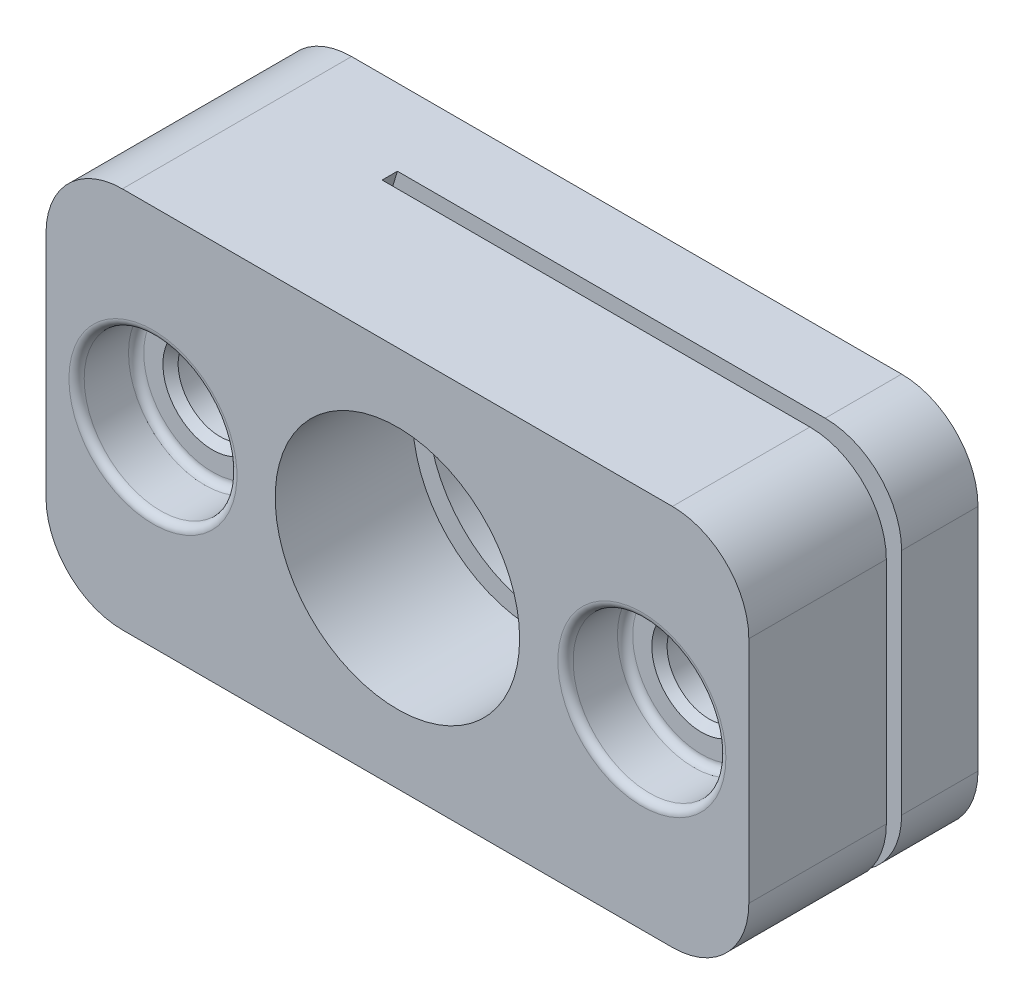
ISO-10303-21;
HEADER;
FILE_DESCRIPTION(('STEP AP214'),'2;1');
FILE_NAME('part.step','',(''),(''),'','','');
FILE_SCHEMA(('AUTOMOTIVE_DESIGN { 1 0 10303 214 1 1 1 1 }'));
ENDSEC;
DATA;
#1=APPLICATION_CONTEXT('core data for automotive mechanical design processes');
#2=APPLICATION_PROTOCOL_DEFINITION('international standard','automotive_design',2000,#1);
#3=PRODUCT_CONTEXT('',#1,'mechanical');
#4=PRODUCT('Part','Part','',(#3));
#5=PRODUCT_RELATED_PRODUCT_CATEGORY('part','',(#4));
#6=PRODUCT_DEFINITION_FORMATION('','',#4);
#7=PRODUCT_DEFINITION_CONTEXT('part definition',#1,'design');
#8=PRODUCT_DEFINITION('design','',#6,#7);
#9=PRODUCT_DEFINITION_SHAPE('','',#8);
#10=(LENGTH_UNIT() NAMED_UNIT(*) SI_UNIT(.MILLI.,.METRE.));
#11=(NAMED_UNIT(*) PLANE_ANGLE_UNIT() SI_UNIT($,.RADIAN.));
#12=(NAMED_UNIT(*) SI_UNIT($,.STERADIAN.) SOLID_ANGLE_UNIT());
#13=UNCERTAINTY_MEASURE_WITH_UNIT(LENGTH_MEASURE(1.E-05),#10,'distance_accuracy_value','');
#14=(GEOMETRIC_REPRESENTATION_CONTEXT(3) GLOBAL_UNCERTAINTY_ASSIGNED_CONTEXT((#13)) GLOBAL_UNIT_ASSIGNED_CONTEXT((#10,
#11,#12)) REPRESENTATION_CONTEXT('',''));
#15=CARTESIAN_POINT('',(0.,0.,0.));
#16=DIRECTION('',(0.,0.,1.));
#17=DIRECTION('',(1.,0.,0.));
#18=AXIS2_PLACEMENT_3D('',#15,#16,#17);
#19=CARTESIAN_POINT('',(35.25,0.,11.1));
#20=DIRECTION('',(0.,0.,1.));
#21=DIRECTION('',(1.,0.,0.));
#22=AXIS2_PLACEMENT_3D('',#19,#20,#21);
#23=PLANE('',#22);
#24=CARTESIAN_POINT('',(32.,0.,11.0999999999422));
#25=DIRECTION('',(0.,0.,1.));
#26=DIRECTION('',(1.,0.,0.));
#27=AXIS2_PLACEMENT_3D('',#24,#25,#26);
#28=CIRCLE('',#27,3.2499999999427);
#29=CARTESIAN_POINT('',(35.2499999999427,0.,11.0999999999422));
#30=VERTEX_POINT('',#29);
#31=EDGE_CURVE('E18',#30,#30,#28,.F.);
#32=ORIENTED_EDGE('',*,*,#31,.T.);
#33=EDGE_LOOP('',(#32));
#34=FACE_BOUND('',#33,.T.);
#35=CARTESIAN_POINT('',(32.,0.,11.1));
#36=DIRECTION('',(0.,0.,-1.));
#37=DIRECTION('',(1.,0.,0.));
#38=AXIS2_PLACEMENT_3D('',#35,#36,#37);
#39=CIRCLE('',#38,4.5);
#40=CARTESIAN_POINT('',(36.5,0.,11.1));
#41=VERTEX_POINT('',#40);
#42=EDGE_CURVE('E285',#41,#41,#39,.F.);
#43=ORIENTED_EDGE('',*,*,#42,.T.);
#44=EDGE_LOOP('',(#43));
#45=FACE_BOUND('',#44,.T.);
#46=ADVANCED_FACE('F14',(#34,#45),#23,.T.);
#47=CARTESIAN_POINT('',(32.,0.,11.6));
#48=DIRECTION('',(0.,0.,1.));
#49=DIRECTION('',(1.,0.,0.));
#50=AXIS2_PLACEMENT_3D('',#47,#48,#49);
#51=TOROIDAL_SURFACE('',#50,4.5,0.5);
#52=CARTESIAN_POINT('',(32.,0.,11.6));
#53=DIRECTION('',(0.,0.,-1.));
#54=DIRECTION('',(-1.,0.,0.));
#55=AXIS2_PLACEMENT_3D('',#52,#53,#54);
#56=CIRCLE('',#55,5.);
#57=CARTESIAN_POINT('',(27.,0.,11.6));
#58=VERTEX_POINT('',#57);
#59=EDGE_CURVE('E234',#58,#58,#56,.F.);
#60=ORIENTED_EDGE('',*,*,#59,.T.);
#61=EDGE_LOOP('',(#60));
#62=FACE_BOUND('',#61,.T.);
#63=ORIENTED_EDGE('',*,*,#42,.F.);
#64=EDGE_LOOP('',(#63));
#65=FACE_BOUND('',#64,.T.);
#66=ADVANCED_FACE('F267',(#62,#65),#51,.F.);
#67=CARTESIAN_POINT('',(0.,0.,11.6));
#68=DIRECTION('',(0.,0.,-1.));
#69=DIRECTION('',(-1.,0.,0.));
#70=AXIS2_PLACEMENT_3D('',#67,#68,#69);
#71=TOROIDAL_SURFACE('',#70,4.5,0.5);
#72=CARTESIAN_POINT('',(0.,0.,11.1));
#73=DIRECTION('',(0.,0.,-1.));
#74=DIRECTION('',(-1.,0.,0.));
#75=AXIS2_PLACEMENT_3D('',#72,#73,#74);
#76=CIRCLE('',#75,4.5);
#77=CARTESIAN_POINT('',(-4.5,0.,11.1));
#78=VERTEX_POINT('',#77);
#79=EDGE_CURVE('E245',#78,#78,#76,.F.);
#80=ORIENTED_EDGE('',*,*,#79,.F.);
#81=EDGE_LOOP('',(#80));
#82=FACE_BOUND('',#81,.T.);
#83=CARTESIAN_POINT('',(0.,0.,11.6));
#84=DIRECTION('',(0.,0.,1.));
#85=DIRECTION('',(1.,0.,0.));
#86=AXIS2_PLACEMENT_3D('',#83,#84,#85);
#87=CIRCLE('',#86,5.);
#88=CARTESIAN_POINT('',(5.,0.,11.6));
#89=VERTEX_POINT('',#88);
#90=EDGE_CURVE('E231',#89,#89,#87,.T.);
#91=ORIENTED_EDGE('',*,*,#90,.T.);
#92=EDGE_LOOP('',(#91));
#93=FACE_BOUND('',#92,.T.);
#94=ADVANCED_FACE('F263',(#82,#93),#71,.F.);
#95=CARTESIAN_POINT('',(-4.5,0.,11.1));
#96=DIRECTION('',(0.,0.,1.));
#97=DIRECTION('',(1.,0.,0.));
#98=AXIS2_PLACEMENT_3D('',#95,#96,#97);
#99=PLANE('',#98);
#100=ORIENTED_EDGE('',*,*,#79,.T.);
#101=EDGE_LOOP('',(#100));
#102=FACE_BOUND('',#101,.T.);
#103=CARTESIAN_POINT('',(0.,0.,11.099999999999));
#104=DIRECTION('',(0.,0.,1.));
#105=DIRECTION('',(1.,0.,0.));
#106=AXIS2_PLACEMENT_3D('',#103,#104,#105);
#107=CIRCLE('',#106,3.25000000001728);
#108=CARTESIAN_POINT('',(3.25000000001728,0.,11.099999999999));
#109=VERTEX_POINT('',#108);
#110=EDGE_CURVE('E228',#109,#109,#107,.F.);
#111=ORIENTED_EDGE('',*,*,#110,.T.);
#112=EDGE_LOOP('',(#111));
#113=FACE_BOUND('',#112,.T.);
#114=ADVANCED_FACE('F252',(#102,#113),#99,.T.);
#115=CARTESIAN_POINT('',(32.,0.,11.0999999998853));
#116=DIRECTION('',(0.,0.,1.));
#117=DIRECTION('',(1.,0.,0.));
#118=AXIS2_PLACEMENT_3D('',#115,#116,#117);
#119=CONICAL_SURFACE('',#118,3.24999999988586,0.785398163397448);
#120=CARTESIAN_POINT('',(32.,0.,10.6));
#121=DIRECTION('',(0.,0.,-1.));
#122=DIRECTION('',(-1.,0.,0.));
#123=AXIS2_PLACEMENT_3D('',#120,#121,#122);
#124=CIRCLE('',#123,2.75);
#125=CARTESIAN_POINT('',(29.25,0.,10.6));
#126=VERTEX_POINT('',#125);
#127=EDGE_CURVE('E224',#126,#126,#124,.T.);
#128=ORIENTED_EDGE('',*,*,#127,.T.);
#129=EDGE_LOOP('',(#128));
#130=FACE_BOUND('',#129,.T.);
#131=ORIENTED_EDGE('',*,*,#31,.F.);
#132=EDGE_LOOP('',(#131));
#133=FACE_BOUND('',#132,.T.);
#134=ADVANCED_FACE('F262',(#130,#133),#119,.F.);
#135=CARTESIAN_POINT('',(32.,0.,15.));
#136=DIRECTION('',(0.,0.,-1.));
#137=DIRECTION('',(-1.,0.,0.));
#138=AXIS2_PLACEMENT_3D('',#135,#136,#137);
#139=CYLINDRICAL_SURFACE('',#138,5.);
#140=ORIENTED_EDGE('',*,*,#59,.F.);
#141=EDGE_LOOP('',(#140));
#142=FACE_BOUND('',#141,.T.);
#143=CARTESIAN_POINT('',(32.,0.,14.5));
#144=DIRECTION('',(0.,0.,1.));
#145=DIRECTION('',(1.,0.,0.));
#146=AXIS2_PLACEMENT_3D('',#143,#144,#145);
#147=CIRCLE('',#146,5.);
#148=CARTESIAN_POINT('',(37.,0.,14.5));
#149=VERTEX_POINT('',#148);
#150=EDGE_CURVE('E125',#149,#149,#147,.F.);
#151=ORIENTED_EDGE('',*,*,#150,.F.);
#152=EDGE_LOOP('',(#151));
#153=FACE_BOUND('',#152,.T.);
#154=ADVANCED_FACE('F505',(#142,#153),#139,.F.);
#155=CARTESIAN_POINT('',(0.,0.,0.));
#156=DIRECTION('',(0.,0.,1.));
#157=DIRECTION('',(1.,0.,0.));
#158=AXIS2_PLACEMENT_3D('',#155,#156,#157);
#159=CYLINDRICAL_SURFACE('',#158,5.);
#160=CARTESIAN_POINT('',(0.,0.,14.5));
#161=DIRECTION('',(0.,0.,-1.));
#162=DIRECTION('',(-1.,0.,0.));
#163=AXIS2_PLACEMENT_3D('',#160,#161,#162);
#164=CIRCLE('',#163,5.);
#165=CARTESIAN_POINT('',(-5.,0.,14.5));
#166=VERTEX_POINT('',#165);
#167=EDGE_CURVE('E171',#166,#166,#164,.T.);
#168=ORIENTED_EDGE('',*,*,#167,.F.);
#169=EDGE_LOOP('',(#168));
#170=FACE_BOUND('',#169,.T.);
#171=ORIENTED_EDGE('',*,*,#90,.F.);
#172=EDGE_LOOP('',(#171));
#173=FACE_BOUND('',#172,.T.);
#174=ADVANCED_FACE('F349',(#170,#173),#159,.F.);
#175=CARTESIAN_POINT('',(0.,0.,11.099999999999));
#176=DIRECTION('',(0.,0.,1.));
#177=DIRECTION('',(1.,0.,0.));
#178=AXIS2_PLACEMENT_3D('',#175,#176,#177);
#179=CONICAL_SURFACE('',#178,3.25000000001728,0.785398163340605);
#180=ORIENTED_EDGE('',*,*,#110,.F.);
#181=EDGE_LOOP('',(#180));
#182=FACE_BOUND('',#181,.T.);
#183=CARTESIAN_POINT('',(0.,0.,10.6));
#184=DIRECTION('',(0.,0.,1.));
#185=DIRECTION('',(1.,0.,0.));
#186=AXIS2_PLACEMENT_3D('',#183,#184,#185);
#187=CIRCLE('',#186,2.75);
#188=CARTESIAN_POINT('',(2.75,0.,10.6));
#189=VERTEX_POINT('',#188);
#190=EDGE_CURVE('E167',#189,#189,#187,.F.);
#191=ORIENTED_EDGE('',*,*,#190,.T.);
#192=EDGE_LOOP('',(#191));
#193=FACE_BOUND('',#192,.T.);
#194=ADVANCED_FACE('F345',(#182,#193),#179,.F.);
#195=CARTESIAN_POINT('',(32.,0.,15.));
#196=DIRECTION('',(0.,0.,-1.));
#197=DIRECTION('',(-1.,0.,0.));
#198=AXIS2_PLACEMENT_3D('',#195,#196,#197);
#199=CYLINDRICAL_SURFACE('',#198,2.75);
#200=CARTESIAN_POINT('',(32.,0.,6.));
#201=DIRECTION('',(0.,0.,-1.));
#202=DIRECTION('',(-1.,0.,0.));
#203=AXIS2_PLACEMENT_3D('',#200,#201,#202);
#204=CIRCLE('',#203,2.75);
#205=CARTESIAN_POINT('',(29.25,0.,6.));
#206=VERTEX_POINT('',#205);
#207=EDGE_CURVE('E135',#206,#206,#204,.T.);
#208=ORIENTED_EDGE('',*,*,#207,.T.);
#209=EDGE_LOOP('',(#208));
#210=FACE_BOUND('',#209,.T.);
#211=ORIENTED_EDGE('',*,*,#127,.F.);
#212=EDGE_LOOP('',(#211));
#213=FACE_BOUND('',#212,.T.);
#214=ADVANCED_FACE('F348',(#210,#213),#199,.F.);
#215=CARTESIAN_POINT('',(43.9967103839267,0.,6.));
#216=DIRECTION('',(0.,0.,1.));
#217=DIRECTION('',(1.,0.,0.));
#218=AXIS2_PLACEMENT_3D('',#215,#216,#217);
#219=CYLINDRICAL_SURFACE('',#218,40.);
#220=DIRECTION('',(0.,0.,1.));
#221=VECTOR('',#220,1.);
#222=CARTESIAN_POINT('',(6.,12.5,6.));
#223=LINE('',#222,#221);
#224=CARTESIAN_POINT('',(6.,12.5,6.));
#225=VERTEX_POINT('',#224);
#226=CARTESIAN_POINT('',(6.,12.5,5.));
#227=VERTEX_POINT('',#226);
#228=EDGE_CURVE('E113',#225,#227,#223,.F.);
#229=ORIENTED_EDGE('',*,*,#228,.F.);
#230=CARTESIAN_POINT('',(43.9967103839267,0.,6.));
#231=DIRECTION('',(0.,0.,1.));
#232=DIRECTION('',(1.,0.,0.));
#233=AXIS2_PLACEMENT_3D('',#230,#231,#232);
#234=CIRCLE('',#233,40.);
#235=CARTESIAN_POINT('',(6.,-12.5,6.));
#236=VERTEX_POINT('',#235);
#237=EDGE_CURVE('E177',#225,#236,#234,.T.);
#238=ORIENTED_EDGE('',*,*,#237,.T.);
#239=DIRECTION('',(0.,0.,1.));
#240=VECTOR('',#239,1.);
#241=CARTESIAN_POINT('',(6.,-12.5,6.));
#242=LINE('',#241,#240);
#243=CARTESIAN_POINT('',(6.,-12.5,5.));
#244=VERTEX_POINT('',#243);
#245=EDGE_CURVE('E126',#244,#236,#242,.T.);
#246=ORIENTED_EDGE('',*,*,#245,.F.);
#247=CARTESIAN_POINT('',(43.9967103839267,0.,5.));
#248=DIRECTION('',(0.,0.,1.));
#249=DIRECTION('',(1.,0.,0.));
#250=AXIS2_PLACEMENT_3D('',#247,#248,#249);
#251=CIRCLE('',#250,40.);
#252=EDGE_CURVE('E130',#227,#244,#251,.T.);
#253=ORIENTED_EDGE('',*,*,#252,.F.);
#254=EDGE_LOOP('',(#229,#238,#246,#253));
#255=FACE_BOUND('',#254,.T.);
#256=ADVANCED_FACE('F131',(#255),#219,.F.);
#257=CARTESIAN_POINT('',(32.,0.,14.5));
#258=DIRECTION('',(0.,0.,1.));
#259=DIRECTION('',(1.,0.,0.));
#260=AXIS2_PLACEMENT_3D('',#257,#258,#259);
#261=TOROIDAL_SURFACE('',#260,5.5,0.5);
#262=ORIENTED_EDGE('',*,*,#150,.T.);
#263=EDGE_LOOP('',(#262));
#264=FACE_BOUND('',#263,.T.);
#265=CARTESIAN_POINT('',(32.,0.,15.));
#266=DIRECTION('',(0.,0.,1.));
#267=DIRECTION('',(1.,0.,0.));
#268=AXIS2_PLACEMENT_3D('',#265,#266,#267);
#269=CIRCLE('',#268,5.50000000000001);
#270=CARTESIAN_POINT('',(37.5,0.,15.));
#271=VERTEX_POINT('',#270);
#272=EDGE_CURVE('E215',#271,#271,#269,.F.);
#273=ORIENTED_EDGE('',*,*,#272,.F.);
#274=EDGE_LOOP('',(#273));
#275=FACE_BOUND('',#274,.T.);
#276=ADVANCED_FACE('F189',(#264,#275),#261,.T.);
#277=CARTESIAN_POINT('',(0.,0.,14.5));
#278=DIRECTION('',(0.,0.,-1.));
#279=DIRECTION('',(-1.,0.,0.));
#280=AXIS2_PLACEMENT_3D('',#277,#278,#279);
#281=TOROIDAL_SURFACE('',#280,5.5,0.5);
#282=CARTESIAN_POINT('',(0.,0.,15.));
#283=DIRECTION('',(0.,0.,1.));
#284=DIRECTION('',(-1.,0.,0.));
#285=AXIS2_PLACEMENT_3D('',#282,#283,#284);
#286=CIRCLE('',#285,5.5);
#287=CARTESIAN_POINT('',(-5.5,0.,15.));
#288=VERTEX_POINT('',#287);
#289=EDGE_CURVE('E331',#288,#288,#286,.F.);
#290=ORIENTED_EDGE('',*,*,#289,.F.);
#291=EDGE_LOOP('',(#290));
#292=FACE_BOUND('',#291,.T.);
#293=ORIENTED_EDGE('',*,*,#167,.T.);
#294=EDGE_LOOP('',(#293));
#295=FACE_BOUND('',#294,.T.);
#296=ADVANCED_FACE('F183',(#292,#295),#281,.T.);
#297=CARTESIAN_POINT('',(39.,-7.5,15.));
#298=DIRECTION('',(-1.,0.,0.));
#299=DIRECTION('',(0.,0.,1.));
#300=AXIS2_PLACEMENT_3D('',#297,#298,#299);
#301=PLANE('',#300);
#302=DIRECTION('',(0.,1.,0.));
#303=VECTOR('',#302,1.);
#304=CARTESIAN_POINT('',(39.,0.,6.));
#305=LINE('',#304,#303);
#306=CARTESIAN_POINT('',(39.,-7.5,6.));
#307=VERTEX_POINT('',#306);
#308=CARTESIAN_POINT('',(39.,7.5,6.));
#309=VERTEX_POINT('',#308);
#310=EDGE_CURVE('E334',#307,#309,#305,.T.);
#311=ORIENTED_EDGE('',*,*,#310,.T.);
#312=DIRECTION('',(0.,0.,1.));
#313=VECTOR('',#312,1.);
#314=CARTESIAN_POINT('',(39.,7.5,15.));
#315=LINE('',#314,#313);
#316=CARTESIAN_POINT('',(39.,7.5,15.));
#317=VERTEX_POINT('',#316);
#318=EDGE_CURVE('E174',#317,#309,#315,.F.);
#319=ORIENTED_EDGE('',*,*,#318,.F.);
#320=DIRECTION('',(0.,1.,0.));
#321=VECTOR('',#320,1.);
#322=CARTESIAN_POINT('',(39.,-7.5,15.));
#323=LINE('',#322,#321);
#324=CARTESIAN_POINT('',(39.,-7.5,15.));
#325=VERTEX_POINT('',#324);
#326=EDGE_CURVE('E327',#325,#317,#323,.T.);
#327=ORIENTED_EDGE('',*,*,#326,.F.);
#328=DIRECTION('',(0.,0.,1.));
#329=VECTOR('',#328,1.);
#330=CARTESIAN_POINT('',(39.,-7.5,15.));
#331=LINE('',#330,#329);
#332=EDGE_CURVE('E170',#307,#325,#331,.T.);
#333=ORIENTED_EDGE('',*,*,#332,.F.);
#334=EDGE_LOOP('',(#311,#319,#327,#333));
#335=FACE_BOUND('',#334,.T.);
#336=ADVANCED_FACE('F188',(#335),#301,.F.);
#337=CARTESIAN_POINT('',(32.,0.,15.));
#338=DIRECTION('',(0.,0.,-1.));
#339=DIRECTION('',(-1.,0.,0.));
#340=AXIS2_PLACEMENT_3D('',#337,#338,#339);
#341=CYLINDRICAL_SURFACE('',#340,2.75);
#342=CARTESIAN_POINT('',(32.,0.,0.499999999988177));
#343=DIRECTION('',(0.,0.,-1.));
#344=DIRECTION('',(-1.,0.,0.));
#345=AXIS2_PLACEMENT_3D('',#342,#343,#344);
#346=CIRCLE('',#345,2.75000000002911);
#347=CARTESIAN_POINT('',(29.2499999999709,0.,0.499999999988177));
#348=VERTEX_POINT('',#347);
#349=EDGE_CURVE('E326',#348,#348,#346,.T.);
#350=ORIENTED_EDGE('',*,*,#349,.T.);
#351=EDGE_LOOP('',(#350));
#352=FACE_BOUND('',#351,.T.);
#353=CARTESIAN_POINT('',(32.,0.,5.));
#354=DIRECTION('',(0.,0.,-1.));
#355=DIRECTION('',(-1.,0.,0.));
#356=AXIS2_PLACEMENT_3D('',#353,#354,#355);
#357=CIRCLE('',#356,2.75);
#358=CARTESIAN_POINT('',(29.25,0.,5.));
#359=VERTEX_POINT('',#358);
#360=EDGE_CURVE('E136',#359,#359,#357,.T.);
#361=ORIENTED_EDGE('',*,*,#360,.F.);
#362=EDGE_LOOP('',(#361));
#363=FACE_BOUND('',#362,.T.);
#364=ADVANCED_FACE('F357',(#352,#363),#341,.F.);
#365=CARTESIAN_POINT('',(0.,0.,0.));
#366=DIRECTION('',(0.,0.,1.));
#367=DIRECTION('',(1.,0.,0.));
#368=AXIS2_PLACEMENT_3D('',#365,#366,#367);
#369=CYLINDRICAL_SURFACE('',#368,2.75);
#370=ORIENTED_EDGE('',*,*,#190,.F.);
#371=EDGE_LOOP('',(#370));
#372=FACE_BOUND('',#371,.T.);
#373=CARTESIAN_POINT('',(0.,0.,0.499999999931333));
#374=DIRECTION('',(0.,0.,-1.));
#375=DIRECTION('',(-1.,0.,0.));
#376=AXIS2_PLACEMENT_3D('',#373,#374,#375);
#377=CIRCLE('',#376,2.75000000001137);
#378=CARTESIAN_POINT('',(-2.75000000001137,0.,0.499999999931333));
#379=VERTEX_POINT('',#378);
#380=EDGE_CURVE('E323',#379,#379,#377,.T.);
#381=ORIENTED_EDGE('',*,*,#380,.T.);
#382=EDGE_LOOP('',(#381));
#383=FACE_BOUND('',#382,.T.);
#384=ADVANCED_FACE('F353',(#372,#383),#369,.F.);
#385=CARTESIAN_POINT('',(34.,-7.5,15.));
#386=DIRECTION('',(0.,0.,1.));
#387=DIRECTION('',(1.,0.,0.));
#388=AXIS2_PLACEMENT_3D('',#385,#386,#387);
#389=CYLINDRICAL_SURFACE('',#388,5.);
#390=ORIENTED_EDGE('',*,*,#332,.T.);
#391=CARTESIAN_POINT('',(34.,-7.5,15.));
#392=DIRECTION('',(0.,0.,1.));
#393=DIRECTION('',(1.,0.,0.));
#394=AXIS2_PLACEMENT_3D('',#391,#392,#393);
#395=CIRCLE('',#394,5.);
#396=CARTESIAN_POINT('',(34.,-12.5,15.));
#397=VERTEX_POINT('',#396);
#398=EDGE_CURVE('E328',#397,#325,#395,.T.);
#399=ORIENTED_EDGE('',*,*,#398,.F.);
#400=DIRECTION('',(0.,0.,1.));
#401=VECTOR('',#400,1.);
#402=CARTESIAN_POINT('',(34.,-12.5,15.));
#403=LINE('',#402,#401);
#404=CARTESIAN_POINT('',(34.,-12.5,6.));
#405=VERTEX_POINT('',#404);
#406=EDGE_CURVE('E157',#397,#405,#403,.F.);
#407=ORIENTED_EDGE('',*,*,#406,.T.);
#408=CARTESIAN_POINT('',(34.,-7.5,6.));
#409=DIRECTION('',(0.,0.,1.));
#410=DIRECTION('',(1.,0.,0.));
#411=AXIS2_PLACEMENT_3D('',#408,#409,#410);
#412=CIRCLE('',#411,5.);
#413=EDGE_CURVE('E335',#405,#307,#412,.T.);
#414=ORIENTED_EDGE('',*,*,#413,.T.);
#415=EDGE_LOOP('',(#390,#399,#407,#414));
#416=FACE_BOUND('',#415,.T.);
#417=ADVANCED_FACE('F356',(#416),#389,.T.);
#418=CARTESIAN_POINT('',(43.9967103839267,0.,5.));
#419=DIRECTION('',(0.,0.,1.));
#420=DIRECTION('',(1.,0.,0.));
#421=AXIS2_PLACEMENT_3D('',#418,#419,#420);
#422=PLANE('',#421);
#423=CARTESIAN_POINT('',(16.,0.,5.));
#424=DIRECTION('',(0.,0.,1.));
#425=DIRECTION('',(1.,0.,0.));
#426=AXIS2_PLACEMENT_3D('',#423,#424,#425);
#427=CIRCLE('',#426,8.);
#428=CARTESIAN_POINT('',(24.,0.,5.));
#429=VERTEX_POINT('',#428);
#430=EDGE_CURVE('E455',#429,#429,#427,.T.);
#431=ORIENTED_EDGE('',*,*,#430,.F.);
#432=EDGE_LOOP('',(#431));
#433=FACE_BOUND('',#432,.T.);
#434=ORIENTED_EDGE('',*,*,#252,.T.);
#435=DIRECTION('',(1.,0.,0.));
#436=VECTOR('',#435,1.);
#437=CARTESIAN_POINT('',(-2.,-12.5,5.));
#438=LINE('',#437,#436);
#439=CARTESIAN_POINT('',(34.,-12.5,5.));
#440=VERTEX_POINT('',#439);
#441=EDGE_CURVE('E153',#244,#440,#438,.T.);
#442=ORIENTED_EDGE('',*,*,#441,.T.);
#443=CARTESIAN_POINT('',(34.,-7.5,5.));
#444=DIRECTION('',(0.,0.,1.));
#445=DIRECTION('',(1.,0.,0.));
#446=AXIS2_PLACEMENT_3D('',#443,#444,#445);
#447=CIRCLE('',#446,5.);
#448=CARTESIAN_POINT('',(39.,-7.5,5.));
#449=VERTEX_POINT('',#448);
#450=EDGE_CURVE('E164',#449,#440,#447,.F.);
#451=ORIENTED_EDGE('',*,*,#450,.F.);
#452=DIRECTION('',(0.,1.,0.));
#453=VECTOR('',#452,1.);
#454=CARTESIAN_POINT('',(39.,-7.5,5.));
#455=LINE('',#454,#453);
#456=CARTESIAN_POINT('',(39.,7.5,5.));
#457=VERTEX_POINT('',#456);
#458=EDGE_CURVE('E150',#449,#457,#455,.T.);
#459=ORIENTED_EDGE('',*,*,#458,.T.);
#460=CARTESIAN_POINT('',(34.,7.5,5.));
#461=DIRECTION('',(0.,0.,1.));
#462=DIRECTION('',(1.,0.,0.));
#463=AXIS2_PLACEMENT_3D('',#460,#461,#462);
#464=CIRCLE('',#463,5.);
#465=CARTESIAN_POINT('',(34.,12.5,5.));
#466=VERTEX_POINT('',#465);
#467=EDGE_CURVE('E141',#466,#457,#464,.F.);
#468=ORIENTED_EDGE('',*,*,#467,.F.);
#469=DIRECTION('',(1.,0.,0.));
#470=VECTOR('',#469,1.);
#471=CARTESIAN_POINT('',(34.,12.5,5.));
#472=LINE('',#471,#470);
#473=EDGE_CURVE('E117',#466,#227,#472,.F.);
#474=ORIENTED_EDGE('',*,*,#473,.T.);
#475=EDGE_LOOP('',(#434,#442,#451,#459,#468,#474));
#476=FACE_BOUND('',#475,.T.);
#477=ORIENTED_EDGE('',*,*,#360,.T.);
#478=EDGE_LOOP('',(#477));
#479=FACE_BOUND('',#478,.T.);
#480=ADVANCED_FACE('F138',(#433,#476,#479),#422,.T.);
#481=CARTESIAN_POINT('',(43.9967103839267,0.,6.));
#482=DIRECTION('',(0.,0.,1.));
#483=DIRECTION('',(1.,0.,0.));
#484=AXIS2_PLACEMENT_3D('',#481,#482,#483);
#485=PLANE('',#484);
#486=CARTESIAN_POINT('',(16.,0.,6.));
#487=DIRECTION('',(0.,0.,1.));
#488=DIRECTION('',(1.,0.,0.));
#489=AXIS2_PLACEMENT_3D('',#486,#487,#488);
#490=CIRCLE('',#489,8.);
#491=CARTESIAN_POINT('',(24.,0.,6.));
#492=VERTEX_POINT('',#491);
#493=EDGE_CURVE('E458',#492,#492,#490,.T.);
#494=ORIENTED_EDGE('',*,*,#493,.T.);
#495=EDGE_LOOP('',(#494));
#496=FACE_BOUND('',#495,.T.);
#497=ORIENTED_EDGE('',*,*,#237,.F.);
#498=DIRECTION('',(1.,0.,0.));
#499=VECTOR('',#498,1.);
#500=CARTESIAN_POINT('',(34.,12.5,6.));
#501=LINE('',#500,#499);
#502=CARTESIAN_POINT('',(34.,12.5,6.));
#503=VERTEX_POINT('',#502);
#504=EDGE_CURVE('E121',#225,#503,#501,.T.);
#505=ORIENTED_EDGE('',*,*,#504,.T.);
#506=CARTESIAN_POINT('',(34.,7.5,6.));
#507=DIRECTION('',(0.,0.,1.));
#508=DIRECTION('',(1.,0.,0.));
#509=AXIS2_PLACEMENT_3D('',#506,#507,#508);
#510=CIRCLE('',#509,5.);
#511=EDGE_CURVE('E176',#309,#503,#510,.T.);
#512=ORIENTED_EDGE('',*,*,#511,.F.);
#513=ORIENTED_EDGE('',*,*,#310,.F.);
#514=ORIENTED_EDGE('',*,*,#413,.F.);
#515=DIRECTION('',(1.,0.,0.));
#516=VECTOR('',#515,1.);
#517=CARTESIAN_POINT('',(-2.,-12.5,6.));
#518=LINE('',#517,#516);
#519=EDGE_CURVE('E160',#405,#236,#518,.F.);
#520=ORIENTED_EDGE('',*,*,#519,.T.);
#521=EDGE_LOOP('',(#497,#505,#512,#513,#514,#520));
#522=FACE_BOUND('',#521,.T.);
#523=ORIENTED_EDGE('',*,*,#207,.F.);
#524=EDGE_LOOP('',(#523));
#525=FACE_BOUND('',#524,.T.);
#526=ADVANCED_FACE('F418',(#496,#522,#525),#485,.F.);
#527=CARTESIAN_POINT('',(34.,7.5,15.));
#528=DIRECTION('',(0.,0.,1.));
#529=DIRECTION('',(1.,0.,0.));
#530=AXIS2_PLACEMENT_3D('',#527,#528,#529);
#531=CYLINDRICAL_SURFACE('',#530,5.);
#532=DIRECTION('',(0.,0.,-1.));
#533=VECTOR('',#532,1.);
#534=CARTESIAN_POINT('',(34.,12.5,15.));
#535=LINE('',#534,#533);
#536=CARTESIAN_POINT('',(34.,12.5,15.));
#537=VERTEX_POINT('',#536);
#538=EDGE_CURVE('E144',#503,#537,#535,.F.);
#539=ORIENTED_EDGE('',*,*,#538,.T.);
#540=CARTESIAN_POINT('',(34.,7.5,15.));
#541=DIRECTION('',(0.,0.,1.));
#542=DIRECTION('',(1.,0.,0.));
#543=AXIS2_PLACEMENT_3D('',#540,#541,#542);
#544=CIRCLE('',#543,5.);
#545=EDGE_CURVE('E324',#317,#537,#544,.T.);
#546=ORIENTED_EDGE('',*,*,#545,.F.);
#547=ORIENTED_EDGE('',*,*,#318,.T.);
#548=ORIENTED_EDGE('',*,*,#511,.T.);
#549=EDGE_LOOP('',(#539,#546,#547,#548));
#550=FACE_BOUND('',#549,.T.);
#551=ADVANCED_FACE('F394',(#550),#531,.T.);
#552=CARTESIAN_POINT('',(-2.,-7.5,15.));
#553=DIRECTION('',(0.,0.,1.));
#554=DIRECTION('',(1.,0.,0.));
#555=AXIS2_PLACEMENT_3D('',#552,#553,#554);
#556=PLANE('',#555);
#557=DIRECTION('',(1.,0.,0.));
#558=VECTOR('',#557,1.);
#559=CARTESIAN_POINT('',(34.,12.5,15.));
#560=LINE('',#559,#558);
#561=CARTESIAN_POINT('',(-2.,12.5,15.));
#562=VERTEX_POINT('',#561);
#563=EDGE_CURVE('E146',#537,#562,#560,.F.);
#564=ORIENTED_EDGE('',*,*,#563,.T.);
#565=CARTESIAN_POINT('',(-2.,7.5,15.));
#566=DIRECTION('',(0.,0.,1.));
#567=DIRECTION('',(1.,0.,0.));
#568=AXIS2_PLACEMENT_3D('',#565,#566,#567);
#569=CIRCLE('',#568,5.);
#570=CARTESIAN_POINT('',(-7.,7.5,15.));
#571=VERTEX_POINT('',#570);
#572=EDGE_CURVE('E315',#571,#562,#569,.F.);
#573=ORIENTED_EDGE('',*,*,#572,.F.);
#574=DIRECTION('',(0.,1.,0.));
#575=VECTOR('',#574,1.);
#576=CARTESIAN_POINT('',(-7.,7.5,15.));
#577=LINE('',#576,#575);
#578=CARTESIAN_POINT('',(-7.,-7.5,15.));
#579=VERTEX_POINT('',#578);
#580=EDGE_CURVE('E372',#571,#579,#577,.F.);
#581=ORIENTED_EDGE('',*,*,#580,.T.);
#582=CARTESIAN_POINT('',(-2.,-7.5,15.));
#583=DIRECTION('',(0.,0.,1.));
#584=DIRECTION('',(1.,0.,0.));
#585=AXIS2_PLACEMENT_3D('',#582,#583,#584);
#586=CIRCLE('',#585,5.);
#587=CARTESIAN_POINT('',(-2.,-12.5,15.));
#588=VERTEX_POINT('',#587);
#589=EDGE_CURVE('E156',#588,#579,#586,.F.);
#590=ORIENTED_EDGE('',*,*,#589,.F.);
#591=DIRECTION('',(1.,0.,0.));
#592=VECTOR('',#591,1.);
#593=CARTESIAN_POINT('',(-2.,-12.5,15.));
#594=LINE('',#593,#592);
#595=EDGE_CURVE('E161',#588,#397,#594,.T.);
#596=ORIENTED_EDGE('',*,*,#595,.T.);
#597=ORIENTED_EDGE('',*,*,#398,.T.);
#598=ORIENTED_EDGE('',*,*,#326,.T.);
#599=ORIENTED_EDGE('',*,*,#545,.T.);
#600=EDGE_LOOP('',(#564,#573,#581,#590,#596,#597,#598,#599));
#601=FACE_BOUND('',#600,.T.);
#602=CARTESIAN_POINT('',(16.,0.,15.));
#603=DIRECTION('',(0.,0.,1.));
#604=DIRECTION('',(1.,0.,0.));
#605=AXIS2_PLACEMENT_3D('',#602,#603,#604);
#606=CIRCLE('',#605,8.);
#607=CARTESIAN_POINT('',(24.,0.,15.));
#608=VERTEX_POINT('',#607);
#609=EDGE_CURVE('E462',#608,#608,#606,.T.);
#610=ORIENTED_EDGE('',*,*,#609,.F.);
#611=EDGE_LOOP('',(#610));
#612=FACE_BOUND('',#611,.T.);
#613=ORIENTED_EDGE('',*,*,#289,.T.);
#614=EDGE_LOOP('',(#613));
#615=FACE_BOUND('',#614,.T.);
#616=ORIENTED_EDGE('',*,*,#272,.T.);
#617=EDGE_LOOP('',(#616));
#618=FACE_BOUND('',#617,.T.);
#619=ADVANCED_FACE('F383',(#601,#612,#615,#618),#556,.T.);
#620=CARTESIAN_POINT('',(32.,0.,0.));
#621=DIRECTION('',(0.,0.,-1.));
#622=DIRECTION('',(-1.,0.,0.));
#623=AXIS2_PLACEMENT_3D('',#620,#621,#622);
#624=CONICAL_SURFACE('',#623,3.25000000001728,0.785398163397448);
#625=CARTESIAN_POINT('',(32.,0.,0.));
#626=DIRECTION('',(0.,0.,-1.));
#627=DIRECTION('',(-1.,0.,0.));
#628=AXIS2_PLACEMENT_3D('',#625,#626,#627);
#629=CIRCLE('',#628,3.25000000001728);
#630=CARTESIAN_POINT('',(28.7499999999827,0.,0.));
#631=VERTEX_POINT('',#630);
#632=EDGE_CURVE('E311',#631,#631,#629,.T.);
#633=ORIENTED_EDGE('',*,*,#632,.T.);
#634=EDGE_LOOP('',(#633));
#635=FACE_BOUND('',#634,.T.);
#636=ORIENTED_EDGE('',*,*,#349,.F.);
#637=EDGE_LOOP('',(#636));
#638=FACE_BOUND('',#637,.T.);
#639=ADVANCED_FACE('F393',(#635,#638),#624,.F.);
#640=CARTESIAN_POINT('',(0.,0.,-5.6843418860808E-11));
#641=DIRECTION('',(0.,0.,-1.));
#642=DIRECTION('',(-1.,0.,0.));
#643=AXIS2_PLACEMENT_3D('',#640,#641,#642);
#644=CONICAL_SURFACE('',#643,3.25000000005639,0.785398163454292);
#645=ORIENTED_EDGE('',*,*,#380,.F.);
#646=EDGE_LOOP('',(#645));
#647=FACE_BOUND('',#646,.T.);
#648=CARTESIAN_POINT('',(0.,0.,5.68434188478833E-11));
#649=DIRECTION('',(0.,0.,-1.));
#650=DIRECTION('',(-1.,0.,0.));
#651=AXIS2_PLACEMENT_3D('',#648,#649,#650);
#652=CIRCLE('',#651,3.2499999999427);
#653=CARTESIAN_POINT('',(-3.2499999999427,0.,5.68434188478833E-11));
#654=VERTEX_POINT('',#653);
#655=EDGE_CURVE('E308',#654,#654,#652,.T.);
#656=ORIENTED_EDGE('',*,*,#655,.T.);
#657=EDGE_LOOP('',(#656));
#658=FACE_BOUND('',#657,.T.);
#659=ADVANCED_FACE('F633',(#647,#658),#644,.F.);
#660=CARTESIAN_POINT('',(-2.,-7.5,15.));
#661=DIRECTION('',(0.,0.,1.));
#662=DIRECTION('',(1.,0.,0.));
#663=AXIS2_PLACEMENT_3D('',#660,#661,#662);
#664=CYLINDRICAL_SURFACE('',#663,5.);
#665=ORIENTED_EDGE('',*,*,#589,.T.);
#666=DIRECTION('',(0.,0.,-1.));
#667=VECTOR('',#666,1.);
#668=CARTESIAN_POINT('',(-7.,-7.5,15.));
#669=LINE('',#668,#667);
#670=CARTESIAN_POINT('',(-7.,-7.5,0.));
#671=VERTEX_POINT('',#670);
#672=EDGE_CURVE('E314',#579,#671,#669,.T.);
#673=ORIENTED_EDGE('',*,*,#672,.T.);
#674=CARTESIAN_POINT('',(-2.,-7.5,0.));
#675=DIRECTION('',(0.,0.,1.));
#676=DIRECTION('',(1.,0.,0.));
#677=AXIS2_PLACEMENT_3D('',#674,#675,#676);
#678=CIRCLE('',#677,5.);
#679=CARTESIAN_POINT('',(-2.,-12.5,0.));
#680=VERTEX_POINT('',#679);
#681=EDGE_CURVE('E305',#671,#680,#678,.T.);
#682=ORIENTED_EDGE('',*,*,#681,.T.);
#683=DIRECTION('',(0.,0.,1.));
#684=VECTOR('',#683,1.);
#685=CARTESIAN_POINT('',(-2.,-12.5,15.));
#686=LINE('',#685,#684);
#687=EDGE_CURVE('E155',#680,#588,#686,.T.);
#688=ORIENTED_EDGE('',*,*,#687,.T.);
#689=EDGE_LOOP('',(#665,#673,#682,#688));
#690=FACE_BOUND('',#689,.T.);
#691=ADVANCED_FACE('F642',(#690),#664,.T.);
#692=CARTESIAN_POINT('',(-2.,-12.5,15.));
#693=DIRECTION('',(0.,1.,0.));
#694=DIRECTION('',(0.,0.,1.));
#695=AXIS2_PLACEMENT_3D('',#692,#693,#694);
#696=PLANE('',#695);
#697=ORIENTED_EDGE('',*,*,#519,.F.);
#698=ORIENTED_EDGE('',*,*,#406,.F.);
#699=ORIENTED_EDGE('',*,*,#595,.F.);
#700=ORIENTED_EDGE('',*,*,#687,.F.);
#701=DIRECTION('',(1.,0.,0.));
#702=VECTOR('',#701,1.);
#703=CARTESIAN_POINT('',(-2.,-12.5,0.));
#704=LINE('',#703,#702);
#705=CARTESIAN_POINT('',(34.,-12.5,0.));
#706=VERTEX_POINT('',#705);
#707=EDGE_CURVE('E304',#680,#706,#704,.T.);
#708=ORIENTED_EDGE('',*,*,#707,.T.);
#709=DIRECTION('',(0.,0.,1.));
#710=VECTOR('',#709,1.);
#711=CARTESIAN_POINT('',(34.,-12.5,15.));
#712=LINE('',#711,#710);
#713=EDGE_CURVE('E321',#440,#706,#712,.F.);
#714=ORIENTED_EDGE('',*,*,#713,.F.);
#715=ORIENTED_EDGE('',*,*,#441,.F.);
#716=ORIENTED_EDGE('',*,*,#245,.T.);
#717=EDGE_LOOP('',(#697,#698,#699,#700,#708,#714,#715,#716));
#718=FACE_BOUND('',#717,.T.);
#719=ADVANCED_FACE('F431',(#718),#696,.F.);
#720=CARTESIAN_POINT('',(34.,-7.5,15.));
#721=DIRECTION('',(0.,0.,1.));
#722=DIRECTION('',(1.,0.,0.));
#723=AXIS2_PLACEMENT_3D('',#720,#721,#722);
#724=CYLINDRICAL_SURFACE('',#723,5.);
#725=CARTESIAN_POINT('',(34.,-7.5,0.));
#726=DIRECTION('',(0.,0.,1.));
#727=DIRECTION('',(1.,0.,0.));
#728=AXIS2_PLACEMENT_3D('',#725,#726,#727);
#729=CIRCLE('',#728,5.);
#730=CARTESIAN_POINT('',(39.,-7.5,0.));
#731=VERTEX_POINT('',#730);
#732=EDGE_CURVE('E301',#706,#731,#729,.T.);
#733=ORIENTED_EDGE('',*,*,#732,.T.);
#734=DIRECTION('',(0.,0.,1.));
#735=VECTOR('',#734,1.);
#736=CARTESIAN_POINT('',(39.,-7.5,15.));
#737=LINE('',#736,#735);
#738=EDGE_CURVE('E152',#731,#449,#737,.T.);
#739=ORIENTED_EDGE('',*,*,#738,.T.);
#740=ORIENTED_EDGE('',*,*,#450,.T.);
#741=ORIENTED_EDGE('',*,*,#713,.T.);
#742=EDGE_LOOP('',(#733,#739,#740,#741));
#743=FACE_BOUND('',#742,.T.);
#744=ADVANCED_FACE('F443',(#743),#724,.T.);
#745=CARTESIAN_POINT('',(39.,-7.5,15.));
#746=DIRECTION('',(-1.,0.,0.));
#747=DIRECTION('',(0.,0.,1.));
#748=AXIS2_PLACEMENT_3D('',#745,#746,#747);
#749=PLANE('',#748);
#750=ORIENTED_EDGE('',*,*,#738,.F.);
#751=DIRECTION('',(0.,1.,0.));
#752=VECTOR('',#751,1.);
#753=CARTESIAN_POINT('',(39.,-7.5,0.));
#754=LINE('',#753,#752);
#755=CARTESIAN_POINT('',(39.,7.5,0.));
#756=VERTEX_POINT('',#755);
#757=EDGE_CURVE('E300',#731,#756,#754,.T.);
#758=ORIENTED_EDGE('',*,*,#757,.T.);
#759=DIRECTION('',(0.,0.,1.));
#760=VECTOR('',#759,1.);
#761=CARTESIAN_POINT('',(39.,7.5,15.));
#762=LINE('',#761,#760);
#763=EDGE_CURVE('E319',#457,#756,#762,.F.);
#764=ORIENTED_EDGE('',*,*,#763,.F.);
#765=ORIENTED_EDGE('',*,*,#458,.F.);
#766=EDGE_LOOP('',(#750,#758,#764,#765));
#767=FACE_BOUND('',#766,.T.);
#768=ADVANCED_FACE('F440',(#767),#749,.F.);
#769=CARTESIAN_POINT('',(34.,7.5,15.));
#770=DIRECTION('',(0.,0.,1.));
#771=DIRECTION('',(1.,0.,0.));
#772=AXIS2_PLACEMENT_3D('',#769,#770,#771);
#773=CYLINDRICAL_SURFACE('',#772,5.);
#774=CARTESIAN_POINT('',(34.,7.5,0.));
#775=DIRECTION('',(0.,0.,1.));
#776=DIRECTION('',(1.,0.,0.));
#777=AXIS2_PLACEMENT_3D('',#774,#775,#776);
#778=CIRCLE('',#777,5.);
#779=CARTESIAN_POINT('',(34.,12.5,0.));
#780=VERTEX_POINT('',#779);
#781=EDGE_CURVE('E297',#756,#780,#778,.T.);
#782=ORIENTED_EDGE('',*,*,#781,.T.);
#783=DIRECTION('',(0.,0.,-1.));
#784=VECTOR('',#783,1.);
#785=CARTESIAN_POINT('',(34.,12.5,15.));
#786=LINE('',#785,#784);
#787=EDGE_CURVE('E142',#780,#466,#786,.F.);
#788=ORIENTED_EDGE('',*,*,#787,.T.);
#789=ORIENTED_EDGE('',*,*,#467,.T.);
#790=ORIENTED_EDGE('',*,*,#763,.T.);
#791=EDGE_LOOP('',(#782,#788,#789,#790));
#792=FACE_BOUND('',#791,.T.);
#793=ADVANCED_FACE('F675',(#792),#773,.T.);
#794=CARTESIAN_POINT('',(34.,12.5,15.));
#795=DIRECTION('',(0.,-1.,0.));
#796=DIRECTION('',(0.,0.,-1.));
#797=AXIS2_PLACEMENT_3D('',#794,#795,#796);
#798=PLANE('',#797);
#799=ORIENTED_EDGE('',*,*,#504,.F.);
#800=ORIENTED_EDGE('',*,*,#228,.T.);
#801=ORIENTED_EDGE('',*,*,#473,.F.);
#802=ORIENTED_EDGE('',*,*,#787,.F.);
#803=DIRECTION('',(1.,0.,0.));
#804=VECTOR('',#803,1.);
#805=CARTESIAN_POINT('',(-2.,12.5,0.));
#806=LINE('',#805,#804);
#807=CARTESIAN_POINT('',(-2.,12.5,0.));
#808=VERTEX_POINT('',#807);
#809=EDGE_CURVE('E296',#780,#808,#806,.F.);
#810=ORIENTED_EDGE('',*,*,#809,.T.);
#811=DIRECTION('',(0.,0.,1.));
#812=VECTOR('',#811,1.);
#813=CARTESIAN_POINT('',(-2.,12.5,15.));
#814=LINE('',#813,#812);
#815=EDGE_CURVE('E317',#562,#808,#814,.F.);
#816=ORIENTED_EDGE('',*,*,#815,.F.);
#817=ORIENTED_EDGE('',*,*,#563,.F.);
#818=ORIENTED_EDGE('',*,*,#538,.F.);
#819=EDGE_LOOP('',(#799,#800,#801,#802,#810,#816,#817,#818));
#820=FACE_BOUND('',#819,.T.);
#821=ADVANCED_FACE('F115',(#820),#798,.F.);
#822=CARTESIAN_POINT('',(-2.,7.5,15.));
#823=DIRECTION('',(0.,0.,1.));
#824=DIRECTION('',(1.,0.,0.));
#825=AXIS2_PLACEMENT_3D('',#822,#823,#824);
#826=CYLINDRICAL_SURFACE('',#825,5.);
#827=ORIENTED_EDGE('',*,*,#572,.T.);
#828=ORIENTED_EDGE('',*,*,#815,.T.);
#829=CARTESIAN_POINT('',(-2.,7.5,0.));
#830=DIRECTION('',(0.,0.,1.));
#831=DIRECTION('',(1.,0.,0.));
#832=AXIS2_PLACEMENT_3D('',#829,#830,#831);
#833=CIRCLE('',#832,5.);
#834=CARTESIAN_POINT('',(-7.,7.5,0.));
#835=VERTEX_POINT('',#834);
#836=EDGE_CURVE('E24',#808,#835,#833,.T.);
#837=ORIENTED_EDGE('',*,*,#836,.T.);
#838=DIRECTION('',(0.,0.,-1.));
#839=VECTOR('',#838,1.);
#840=CARTESIAN_POINT('',(-7.,7.5,15.));
#841=LINE('',#840,#839);
#842=EDGE_CURVE('E32',#835,#571,#841,.F.);
#843=ORIENTED_EDGE('',*,*,#842,.T.);
#844=EDGE_LOOP('',(#827,#828,#837,#843));
#845=FACE_BOUND('',#844,.T.);
#846=ADVANCED_FACE('F693',(#845),#826,.T.);
#847=CARTESIAN_POINT('',(-7.,7.5,15.));
#848=DIRECTION('',(1.,0.,0.));
#849=DIRECTION('',(0.,0.,-1.));
#850=AXIS2_PLACEMENT_3D('',#847,#848,#849);
#851=PLANE('',#850);
#852=ORIENTED_EDGE('',*,*,#672,.F.);
#853=ORIENTED_EDGE('',*,*,#580,.F.);
#854=ORIENTED_EDGE('',*,*,#842,.F.);
#855=DIRECTION('',(0.,1.,0.));
#856=VECTOR('',#855,1.);
#857=CARTESIAN_POINT('',(-7.,-7.5,0.));
#858=LINE('',#857,#856);
#859=EDGE_CURVE('E9',#835,#671,#858,.F.);
#860=ORIENTED_EDGE('',*,*,#859,.T.);
#861=EDGE_LOOP('',(#852,#853,#854,#860));
#862=FACE_BOUND('',#861,.T.);
#863=ADVANCED_FACE('F482',(#862),#851,.F.);
#864=CARTESIAN_POINT('',(-2.,-7.5,0.));
#865=DIRECTION('',(0.,0.,1.));
#866=DIRECTION('',(1.,0.,0.));
#867=AXIS2_PLACEMENT_3D('',#864,#865,#866);
#868=PLANE('',#867);
#869=ORIENTED_EDGE('',*,*,#836,.F.);
#870=ORIENTED_EDGE('',*,*,#809,.F.);
#871=ORIENTED_EDGE('',*,*,#781,.F.);
#872=ORIENTED_EDGE('',*,*,#757,.F.);
#873=ORIENTED_EDGE('',*,*,#732,.F.);
#874=ORIENTED_EDGE('',*,*,#707,.F.);
#875=ORIENTED_EDGE('',*,*,#681,.F.);
#876=ORIENTED_EDGE('',*,*,#859,.F.);
#877=EDGE_LOOP('',(#869,#870,#871,#872,#873,#874,#875,#876));
#878=FACE_BOUND('',#877,.T.);
#879=CARTESIAN_POINT('',(16.,0.,0.));
#880=DIRECTION('',(0.,0.,1.));
#881=DIRECTION('',(1.,0.,0.));
#882=AXIS2_PLACEMENT_3D('',#879,#880,#881);
#883=CIRCLE('',#882,8.);
#884=CARTESIAN_POINT('',(24.,0.,0.));
#885=VERTEX_POINT('',#884);
#886=EDGE_CURVE('E461',#885,#885,#883,.T.);
#887=ORIENTED_EDGE('',*,*,#886,.T.);
#888=EDGE_LOOP('',(#887));
#889=FACE_BOUND('',#888,.T.);
#890=ORIENTED_EDGE('',*,*,#655,.F.);
#891=EDGE_LOOP('',(#890));
#892=FACE_BOUND('',#891,.T.);
#893=ORIENTED_EDGE('',*,*,#632,.F.);
#894=EDGE_LOOP('',(#893));
#895=FACE_BOUND('',#894,.T.);
#896=ADVANCED_FACE('F468',(#878,#889,#892,#895),#868,.F.);
#897=CARTESIAN_POINT('',(16.,0.,0.));
#898=DIRECTION('',(0.,0.,1.));
#899=DIRECTION('',(1.,0.,0.));
#900=AXIS2_PLACEMENT_3D('',#897,#898,#899);
#901=CYLINDRICAL_SURFACE('',#900,8.);
#902=ORIENTED_EDGE('',*,*,#430,.T.);
#903=EDGE_LOOP('',(#902));
#904=FACE_BOUND('',#903,.T.);
#905=ORIENTED_EDGE('',*,*,#886,.F.);
#906=EDGE_LOOP('',(#905));
#907=FACE_BOUND('',#906,.T.);
#908=ADVANCED_FACE('F471',(#904,#907),#901,.F.);
#909=ORIENTED_EDGE('',*,*,#609,.T.);
#910=EDGE_LOOP('',(#909));
#911=FACE_BOUND('',#910,.T.);
#912=ORIENTED_EDGE('',*,*,#493,.F.);
#913=EDGE_LOOP('',(#912));
#914=FACE_BOUND('',#913,.T.);
#915=ADVANCED_FACE('F473',(#911,#914),#901,.F.);
#916=CLOSED_SHELL('',(#46,#66,#94,#114,#134,#154,#174,#194,#214,#256,#276,#296,#336,#364,#384,
#417,#480,#526,#551,#619,#639,#659,#691,#719,#744,#768,#793,#821,#846,#863,#896,#908,#915));
#917=MANIFOLD_SOLID_BREP('B1',#916);
#918=ADVANCED_BREP_SHAPE_REPRESENTATION('',(#18,#917),#14);
#919=SHAPE_DEFINITION_REPRESENTATION(#9,#918);
ENDSEC;
END-ISO-10303-21;
